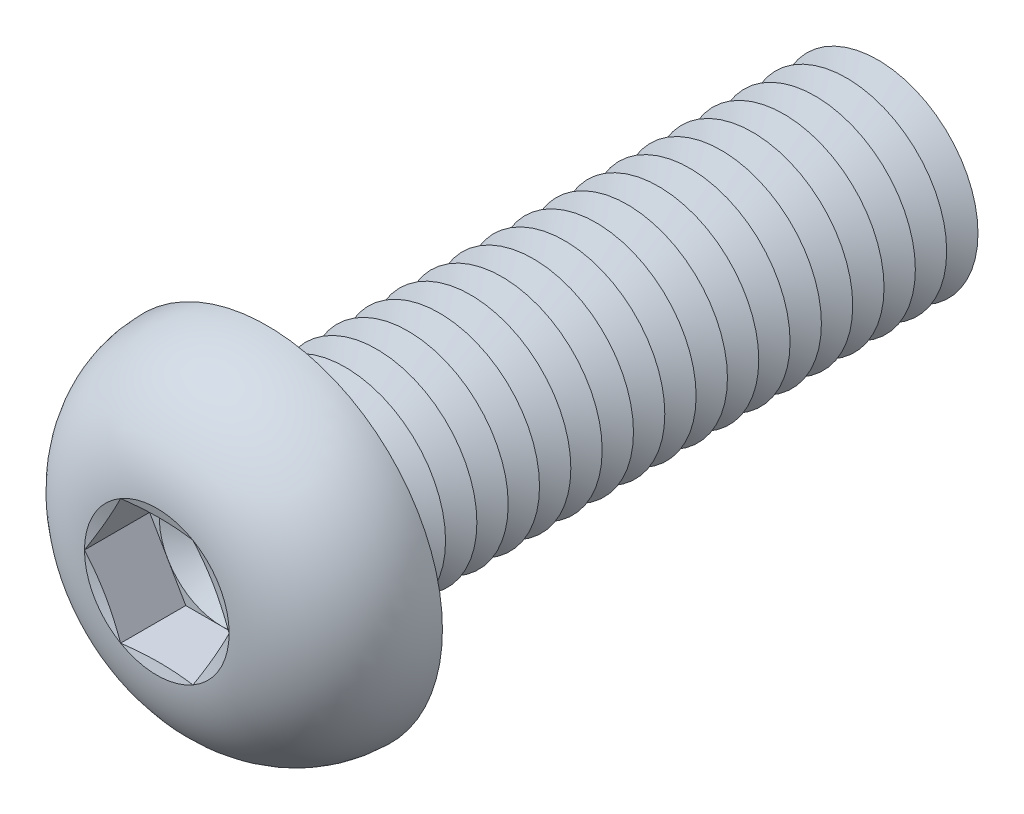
from build123d import *

# Parameters (mm, degrees)
FILLET1_R          = 0.625
LPATTERN1_COUNT    = 20
LPATTERN1_PITCH    = 1.25
CUT_EXTRUDE1_DEPTH = 2.6


with BuildPart() as part:
    # Sketch1 → Revolve1 (revolve)
    with BuildSketch(Plane(origin=(0, 0, 0), x_dir=(0, 0, -1), z_dir=(1, 0, 0)), mode=Mode.PRIVATE) as revolve1_sk:
        with BuildLine():
            Line((0, 4), (0, 7))
            ThreePointArc((0, 7), (-3.011595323, 5.81154966), (-4.4, 2.88675))
            Line((-4.4, 2.88675), (-4.013248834, 1.443375))
            Line((-4.013248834, 1.443375), (-4.4, 1.443375))
            Line((-4.4, 1.443375), (-4.4, 0))
            Line((-4.4, 0), (25, 0))
            Line((25, 0), (25, 4))
            Line((25, 4), (0, 4))
        make_face()
    revolve(revolve1_sk.sketch.rotate(Axis((0, 0, -25), (0, 0, 1)), 90), axis=Axis((0, 0, -25), (0, 0, 1)))

    # Fillet1
    fillet1_edges = [part.edges().sort_by_distance(p)[0] for p in [
        (4, 0, 0),
    ]]
    fillet(fillet1_edges, radius=FILLET1_R)

    # Sketch2 → Cut-Revolve1 (revolve, cut)
    with BuildSketch(Plane(origin=(0, 0, 0), x_dir=(0, 0, -1), z_dir=(1, 0, 0)), mode=Mode.PRIVATE) as cut_revolve1_sk:
        Polygon((24.375, 4), (25.625, 4), (25, 2.917468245), align=None)
    cut_revolve1 = revolve(cut_revolve1_sk.sketch.rotate(Axis((0, 0, -25), (0, 0, -1)), 270), axis=Axis((0, 0, -25), (0, 0, -1)), mode=Mode.SUBTRACT)

    # LPattern1: Cut-Revolve1 ×20
    with Locations(*[(0, 0, i * LPATTERN1_PITCH) for i in range(1, LPATTERN1_COUNT)]):
        add(cut_revolve1, mode=Mode.SUBTRACT)

    # Sketch3 → Cut-Extrude1 (cut)
    with BuildSketch(Plane.XY.offset(4.4)):
        Polygon((1.443375, 2.499998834), (-1.443375, 2.499998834), (-2.88675, 0), (-1.443375, -2.499998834), (1.443375, -2.499998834), (2.88675, 0), align=None)
    extrude(amount=-CUT_EXTRUDE1_DEPTH, mode=Mode.SUBTRACT)

    # Cut-Extrude2 cone 1 section (on through the dimple's axis) → Cut-Extrude2 (revolve, cut)
    with BuildSketch(Plane(origin=(0, 0, 1.8), x_dir=(0, -1, 0), z_dir=(1, 0, 0))):
        Polygon((0, 0), (2.499998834, 0), (0, 1.443375), align=None)
    revolve(axis=Axis((0, 0, 1.8), (0, 0, -1)), mode=Mode.SUBTRACT)


solid = part.part
